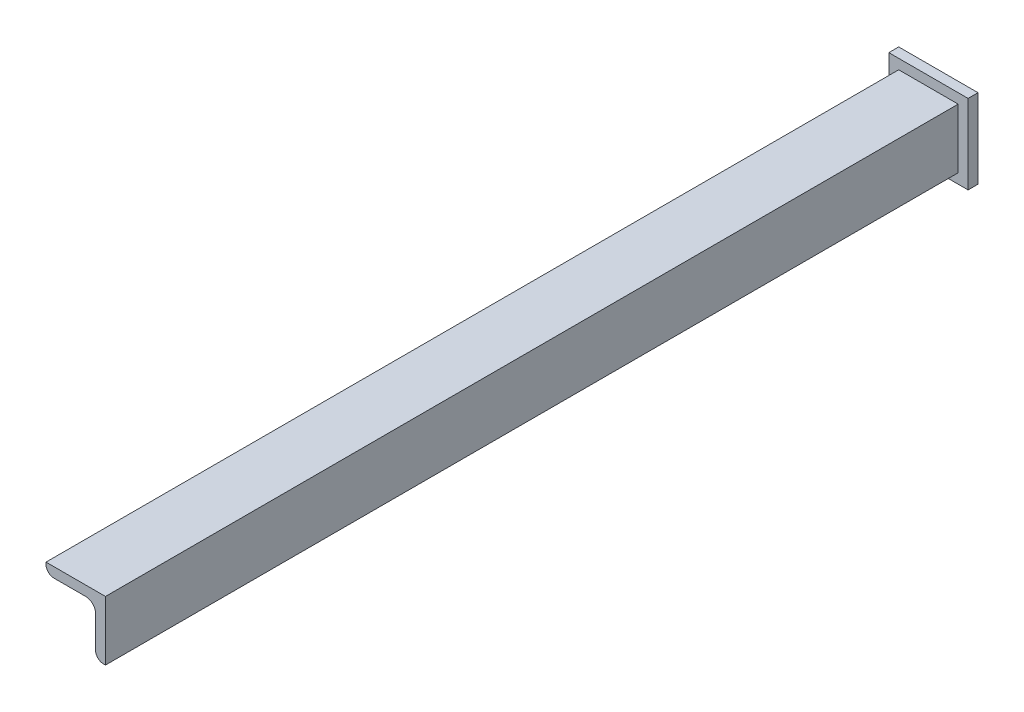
ISO-10303-21;
HEADER;
FILE_DESCRIPTION(('STEP AP214'),'2;1');
FILE_NAME('part.step','',(''),(''),'','','');
FILE_SCHEMA(('AUTOMOTIVE_DESIGN { 1 0 10303 214 1 1 1 1 }'));
ENDSEC;
DATA;
#1=APPLICATION_CONTEXT('core data for automotive mechanical design processes');
#2=APPLICATION_PROTOCOL_DEFINITION('international standard','automotive_design',2000,#1);
#3=PRODUCT_CONTEXT('',#1,'mechanical');
#4=PRODUCT('Part','Part','',(#3));
#5=PRODUCT_RELATED_PRODUCT_CATEGORY('part','',(#4));
#6=PRODUCT_DEFINITION_FORMATION('','',#4);
#7=PRODUCT_DEFINITION_CONTEXT('part definition',#1,'design');
#8=PRODUCT_DEFINITION('design','',#6,#7);
#9=PRODUCT_DEFINITION_SHAPE('','',#8);
#10=(LENGTH_UNIT() NAMED_UNIT(*) SI_UNIT(.MILLI.,.METRE.));
#11=(NAMED_UNIT(*) PLANE_ANGLE_UNIT() SI_UNIT($,.RADIAN.));
#12=(NAMED_UNIT(*) SI_UNIT($,.STERADIAN.) SOLID_ANGLE_UNIT());
#13=UNCERTAINTY_MEASURE_WITH_UNIT(LENGTH_MEASURE(1.E-05),#10,'distance_accuracy_value','');
#14=(GEOMETRIC_REPRESENTATION_CONTEXT(3) GLOBAL_UNCERTAINTY_ASSIGNED_CONTEXT((#13)) GLOBAL_UNIT_ASSIGNED_CONTEXT((#10,
#11,#12)) REPRESENTATION_CONTEXT('',''));
#15=CARTESIAN_POINT('',(0.,0.,0.));
#16=DIRECTION('',(0.,0.,1.));
#17=DIRECTION('',(1.,0.,0.));
#18=AXIS2_PLACEMENT_3D('',#15,#16,#17);
#19=CARTESIAN_POINT('',(0.,0.,10.));
#20=DIRECTION('',(0.,0.,-1.));
#21=DIRECTION('',(-1.,0.,0.));
#22=AXIS2_PLACEMENT_3D('',#19,#20,#21);
#23=PLANE('',#22);
#24=CARTESIAN_POINT('',(2981.89372495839,-50.1062373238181,10.));
#25=DIRECTION('',(0.,0.,1.));
#26=DIRECTION('',(1.,0.,0.));
#27=AXIS2_PLACEMENT_3D('',#24,#25,#26);
#28=CIRCLE('',#27,7.49999999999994);
#29=CARTESIAN_POINT('',(2989.39372495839,-50.1062373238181,10.));
#30=VERTEX_POINT('',#29);
#31=EDGE_CURVE('E411',#30,#30,#28,.T.);
#32=ORIENTED_EDGE('',*,*,#31,.F.);
#33=EDGE_LOOP('',(#32));
#34=FACE_BOUND('',#33,.T.);
#35=DIRECTION('',(1.,0.,0.));
#36=VECTOR('',#35,1.);
#37=CARTESIAN_POINT('',(2951.999903,0.,10.));
#38=LINE('',#37,#36);
#39=CARTESIAN_POINT('',(2951.999903,0.,10.));
#40=VERTEX_POINT('',#39);
#41=CARTESIAN_POINT('',(3032.000065,0.,10.));
#42=VERTEX_POINT('',#41);
#43=EDGE_CURVE('E181',#40,#42,#38,.T.);
#44=ORIENTED_EDGE('',*,*,#43,.F.);
#45=DIRECTION('',(0.,1.,0.));
#46=VECTOR('',#45,1.);
#47=CARTESIAN_POINT('',(2951.999903,-79.999998,10.));
#48=LINE('',#47,#46);
#49=CARTESIAN_POINT('',(2951.999903,-79.999998,10.));
#50=VERTEX_POINT('',#49);
#51=EDGE_CURVE('E191',#50,#40,#48,.T.);
#52=ORIENTED_EDGE('',*,*,#51,.F.);
#53=DIRECTION('',(-1.,0.,0.));
#54=VECTOR('',#53,1.);
#55=CARTESIAN_POINT('',(3032.000065,-79.999998,10.));
#56=LINE('',#55,#54);
#57=CARTESIAN_POINT('',(3032.000065,-79.999998,10.));
#58=VERTEX_POINT('',#57);
#59=EDGE_CURVE('E188',#58,#50,#56,.T.);
#60=ORIENTED_EDGE('',*,*,#59,.F.);
#61=DIRECTION('',(0.,-1.,0.));
#62=VECTOR('',#61,1.);
#63=CARTESIAN_POINT('',(3032.000065,0.,10.));
#64=LINE('',#63,#62);
#65=EDGE_CURVE('E184',#42,#58,#64,.T.);
#66=ORIENTED_EDGE('',*,*,#65,.F.);
#67=EDGE_LOOP('',(#44,#52,#60,#66));
#68=FACE_BOUND('',#67,.T.);
#69=DIRECTION('',(0.,-1.,0.));
#70=VECTOR('',#69,1.);
#71=CARTESIAN_POINT('',(3012.000084,-70.,10.));
#72=LINE('',#71,#70);
#73=CARTESIAN_POINT('',(3012.000084,-30.0040008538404,10.));
#74=VERTEX_POINT('',#73);
#75=CARTESIAN_POINT('',(3012.000084,-62.,10.));
#76=VERTEX_POINT('',#75);
#77=EDGE_CURVE('E168',#74,#76,#72,.T.);
#78=ORIENTED_EDGE('',*,*,#77,.F.);
#79=CARTESIAN_POINT('',(3002.000084,-30.0040008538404,10.));
#80=DIRECTION('',(0.,0.,-1.));
#81=DIRECTION('',(-1.,0.,0.));
#82=AXIS2_PLACEMENT_3D('',#79,#80,#81);
#83=CIRCLE('',#82,10.);
#84=CARTESIAN_POINT('',(3002.00108419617,-20.00400090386,10.));
#85=VERTEX_POINT('',#84);
#86=EDGE_CURVE('E215',#74,#85,#83,.F.);
#87=ORIENTED_EDGE('',*,*,#86,.T.);
#88=DIRECTION('',(0.999999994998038,-0.000100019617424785,0.));
#89=VECTOR('',#88,1.);
#90=CARTESIAN_POINT('',(3012.000084,-20.005001,10.));
#91=LINE('',#90,#89);
#92=CARTESIAN_POINT('',(2969.99909284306,-20.000800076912,10.));
#93=VERTEX_POINT('',#92);
#94=EDGE_CURVE('E165',#93,#85,#91,.T.);
#95=ORIENTED_EDGE('',*,*,#94,.F.);
#96=CARTESIAN_POINT('',(2969.999893,-12.0008001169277,10.));
#97=DIRECTION('',(0.,0.,-1.));
#98=DIRECTION('',(-1.,0.,0.));
#99=AXIS2_PLACEMENT_3D('',#96,#97,#98);
#100=CIRCLE('',#99,8.);
#101=CARTESIAN_POINT('',(2961.999893,-12.0008001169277,10.));
#102=VERTEX_POINT('',#101);
#103=EDGE_CURVE('E11',#93,#102,#100,.T.);
#104=ORIENTED_EDGE('',*,*,#103,.T.);
#105=DIRECTION('',(0.,-1.,0.));
#106=VECTOR('',#105,1.);
#107=CARTESIAN_POINT('',(2961.999893,-20.,10.));
#108=LINE('',#107,#106);
#109=CARTESIAN_POINT('',(2961.999893,-10.,10.));
#110=VERTEX_POINT('',#109);
#111=EDGE_CURVE('E163',#110,#102,#108,.T.);
#112=ORIENTED_EDGE('',*,*,#111,.F.);
#113=DIRECTION('',(-0.999999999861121,-1.66660864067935E-05,0.));
#114=VECTOR('',#113,1.);
#115=CARTESIAN_POINT('',(2961.999893,-10.,10.));
#116=LINE('',#115,#114);
#117=CARTESIAN_POINT('',(3022.001982,-9.999,10.));
#118=VERTEX_POINT('',#117);
#119=EDGE_CURVE('E174',#118,#110,#116,.T.);
#120=ORIENTED_EDGE('',*,*,#119,.F.);
#121=DIRECTION('',(3.17994700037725E-05,0.999999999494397,0.));
#122=VECTOR('',#121,1.);
#123=CARTESIAN_POINT('',(3022.001982,-9.999,10.));
#124=LINE('',#123,#122);
#125=CARTESIAN_POINT('',(3022.000074,-70.,10.));
#126=VERTEX_POINT('',#125);
#127=EDGE_CURVE('E172',#126,#118,#124,.T.);
#128=ORIENTED_EDGE('',*,*,#127,.F.);
#129=DIRECTION('',(1.,0.,0.));
#130=VECTOR('',#129,1.);
#131=CARTESIAN_POINT('',(3022.000074,-70.,10.));
#132=LINE('',#131,#130);
#133=CARTESIAN_POINT('',(3020.000084,-70.,10.));
#134=VERTEX_POINT('',#133);
#135=EDGE_CURVE('E147',#134,#126,#132,.T.);
#136=ORIENTED_EDGE('',*,*,#135,.F.);
#137=CARTESIAN_POINT('',(3020.000084,-62.,10.));
#138=DIRECTION('',(0.,0.,-1.));
#139=DIRECTION('',(-1.,0.,0.));
#140=AXIS2_PLACEMENT_3D('',#137,#138,#139);
#141=CIRCLE('',#140,8.);
#142=EDGE_CURVE('E45',#134,#76,#141,.T.);
#143=ORIENTED_EDGE('',*,*,#142,.T.);
#144=EDGE_LOOP('',(#78,#87,#95,#104,#112,#120,#128,#136,#143));
#145=FACE_BOUND('',#144,.T.);
#146=ADVANCED_FACE('F37',(#34,#68,#145),#23,.F.);
#147=CARTESIAN_POINT('',(2951.999903,0.,10.));
#148=DIRECTION('',(0.,1.,0.));
#149=DIRECTION('',(0.,0.,1.));
#150=AXIS2_PLACEMENT_3D('',#147,#148,#149);
#151=PLANE('',#150);
#152=DIRECTION('',(1.,0.,0.));
#153=VECTOR('',#152,1.);
#154=CARTESIAN_POINT('',(2951.999903,0.,0.));
#155=LINE('',#154,#153);
#156=CARTESIAN_POINT('',(2951.999903,0.,0.));
#157=VERTEX_POINT('',#156);
#158=CARTESIAN_POINT('',(3032.000065,0.,0.));
#159=VERTEX_POINT('',#158);
#160=EDGE_CURVE('E151',#157,#159,#155,.T.);
#161=ORIENTED_EDGE('',*,*,#160,.F.);
#162=DIRECTION('',(0.,0.,-1.));
#163=VECTOR('',#162,1.);
#164=CARTESIAN_POINT('',(2951.999903,0.,10.));
#165=LINE('',#164,#163);
#166=EDGE_CURVE('E205',#40,#157,#165,.T.);
#167=ORIENTED_EDGE('',*,*,#166,.F.);
#168=ORIENTED_EDGE('',*,*,#43,.T.);
#169=DIRECTION('',(0.,0.,-1.));
#170=VECTOR('',#169,1.);
#171=CARTESIAN_POINT('',(3032.000065,0.,10.));
#172=LINE('',#171,#170);
#173=EDGE_CURVE('E194',#42,#159,#172,.T.);
#174=ORIENTED_EDGE('',*,*,#173,.T.);
#175=EDGE_LOOP('',(#161,#167,#168,#174));
#176=FACE_BOUND('',#175,.T.);
#177=ADVANCED_FACE('F251',(#176),#151,.T.);
#178=CARTESIAN_POINT('',(2951.999903,-79.999998,10.));
#179=DIRECTION('',(-1.,0.,0.));
#180=DIRECTION('',(0.,0.,1.));
#181=AXIS2_PLACEMENT_3D('',#178,#179,#180);
#182=PLANE('',#181);
#183=DIRECTION('',(0.,1.,0.));
#184=VECTOR('',#183,1.);
#185=CARTESIAN_POINT('',(2951.999903,-79.999998,0.));
#186=LINE('',#185,#184);
#187=CARTESIAN_POINT('',(2951.999903,-79.999998,0.));
#188=VERTEX_POINT('',#187);
#189=EDGE_CURVE('E185',#188,#157,#186,.T.);
#190=ORIENTED_EDGE('',*,*,#189,.F.);
#191=DIRECTION('',(0.,0.,-1.));
#192=VECTOR('',#191,1.);
#193=CARTESIAN_POINT('',(2951.999903,-79.999998,10.));
#194=LINE('',#193,#192);
#195=EDGE_CURVE('E208',#50,#188,#194,.T.);
#196=ORIENTED_EDGE('',*,*,#195,.F.);
#197=ORIENTED_EDGE('',*,*,#51,.T.);
#198=ORIENTED_EDGE('',*,*,#166,.T.);
#199=EDGE_LOOP('',(#190,#196,#197,#198));
#200=FACE_BOUND('',#199,.T.);
#201=ADVANCED_FACE('F257',(#200),#182,.T.);
#202=CARTESIAN_POINT('',(3032.000065,-79.999998,10.));
#203=DIRECTION('',(0.,-1.,0.));
#204=DIRECTION('',(0.,0.,-1.));
#205=AXIS2_PLACEMENT_3D('',#202,#203,#204);
#206=PLANE('',#205);
#207=DIRECTION('',(-1.,0.,0.));
#208=VECTOR('',#207,1.);
#209=CARTESIAN_POINT('',(3032.000065,-79.999998,0.));
#210=LINE('',#209,#208);
#211=CARTESIAN_POINT('',(3032.000065,-79.999998,0.));
#212=VERTEX_POINT('',#211);
#213=EDGE_CURVE('E200',#212,#188,#210,.T.);
#214=ORIENTED_EDGE('',*,*,#213,.F.);
#215=DIRECTION('',(0.,0.,-1.));
#216=VECTOR('',#215,1.);
#217=CARTESIAN_POINT('',(3032.000065,-79.999998,10.));
#218=LINE('',#217,#216);
#219=EDGE_CURVE('E210',#58,#212,#218,.T.);
#220=ORIENTED_EDGE('',*,*,#219,.F.);
#221=ORIENTED_EDGE('',*,*,#59,.T.);
#222=ORIENTED_EDGE('',*,*,#195,.T.);
#223=EDGE_LOOP('',(#214,#220,#221,#222));
#224=FACE_BOUND('',#223,.T.);
#225=ADVANCED_FACE('F273',(#224),#206,.T.);
#226=CARTESIAN_POINT('',(3032.000065,0.,10.));
#227=DIRECTION('',(1.,0.,0.));
#228=DIRECTION('',(0.,0.,-1.));
#229=AXIS2_PLACEMENT_3D('',#226,#227,#228);
#230=PLANE('',#229);
#231=DIRECTION('',(0.,-1.,0.));
#232=VECTOR('',#231,1.);
#233=CARTESIAN_POINT('',(3032.000065,0.,0.));
#234=LINE('',#233,#232);
#235=EDGE_CURVE('E197',#159,#212,#234,.T.);
#236=ORIENTED_EDGE('',*,*,#235,.F.);
#237=ORIENTED_EDGE('',*,*,#173,.F.);
#238=ORIENTED_EDGE('',*,*,#65,.T.);
#239=ORIENTED_EDGE('',*,*,#219,.T.);
#240=EDGE_LOOP('',(#236,#237,#238,#239));
#241=FACE_BOUND('',#240,.T.);
#242=ADVANCED_FACE('F269',(#241),#230,.T.);
#243=CARTESIAN_POINT('',(0.,0.,0.));
#244=DIRECTION('',(0.,0.,-1.));
#245=DIRECTION('',(-1.,0.,0.));
#246=AXIS2_PLACEMENT_3D('',#243,#244,#245);
#247=PLANE('',#246);
#248=CARTESIAN_POINT('',(2981.89372495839,-50.1062373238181,0.));
#249=DIRECTION('',(0.,0.,1.));
#250=DIRECTION('',(1.,0.,0.));
#251=AXIS2_PLACEMENT_3D('',#248,#249,#250);
#252=CIRCLE('',#251,7.49999999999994);
#253=CARTESIAN_POINT('',(2989.39372495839,-50.1062373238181,0.));
#254=VERTEX_POINT('',#253);
#255=EDGE_CURVE('E166',#254,#254,#252,.T.);
#256=ORIENTED_EDGE('',*,*,#255,.T.);
#257=EDGE_LOOP('',(#256));
#258=FACE_BOUND('',#257,.T.);
#259=ORIENTED_EDGE('',*,*,#160,.T.);
#260=ORIENTED_EDGE('',*,*,#235,.T.);
#261=ORIENTED_EDGE('',*,*,#213,.T.);
#262=ORIENTED_EDGE('',*,*,#189,.T.);
#263=EDGE_LOOP('',(#259,#260,#261,#262));
#264=FACE_BOUND('',#263,.T.);
#265=ADVANCED_FACE('F266',(#258,#264),#247,.T.);
#266=CARTESIAN_POINT('',(2961.999893,-20.,870.31));
#267=DIRECTION('',(1.,0.,0.));
#268=DIRECTION('',(0.,0.,-1.));
#269=AXIS2_PLACEMENT_3D('',#266,#267,#268);
#270=PLANE('',#269);
#271=ORIENTED_EDGE('',*,*,#111,.T.);
#272=DIRECTION('',(0.,0.,-1.));
#273=VECTOR('',#272,1.);
#274=CARTESIAN_POINT('',(2961.999893,-12.0008001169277,870.31));
#275=LINE('',#274,#273);
#276=CARTESIAN_POINT('',(2961.999893,-12.0008001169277,870.31));
#277=VERTEX_POINT('',#276);
#278=EDGE_CURVE('E232',#102,#277,#275,.F.);
#279=ORIENTED_EDGE('',*,*,#278,.T.);
#280=DIRECTION('',(0.,-1.,0.));
#281=VECTOR('',#280,1.);
#282=CARTESIAN_POINT('',(2961.999893,-20.,870.31));
#283=LINE('',#282,#281);
#284=CARTESIAN_POINT('',(2961.999893,-10.,870.31));
#285=VERTEX_POINT('',#284);
#286=EDGE_CURVE('E177',#285,#277,#283,.T.);
#287=ORIENTED_EDGE('',*,*,#286,.F.);
#288=DIRECTION('',(0.,0.,-1.));
#289=VECTOR('',#288,1.);
#290=CARTESIAN_POINT('',(2961.999893,-10.,870.31));
#291=LINE('',#290,#289);
#292=EDGE_CURVE('E159',#285,#110,#291,.T.);
#293=ORIENTED_EDGE('',*,*,#292,.T.);
#294=EDGE_LOOP('',(#271,#279,#287,#293));
#295=FACE_BOUND('',#294,.T.);
#296=ADVANCED_FACE('F264',(#295),#270,.F.);
#297=CARTESIAN_POINT('',(3012.000084,-20.005001,870.31));
#298=DIRECTION('',(0.000100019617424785,0.999999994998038,0.));
#299=DIRECTION('',(-0.999999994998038,0.000100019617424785,0.));
#300=AXIS2_PLACEMENT_3D('',#297,#298,#299);
#301=PLANE('',#300);
#302=DIRECTION('',(0.999999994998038,-0.000100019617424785,0.));
#303=VECTOR('',#302,1.);
#304=CARTESIAN_POINT('',(3012.000084,-20.005001,870.31));
#305=LINE('',#304,#303);
#306=CARTESIAN_POINT('',(2969.99909284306,-20.000800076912,870.31));
#307=VERTEX_POINT('',#306);
#308=CARTESIAN_POINT('',(3002.00108419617,-20.00400090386,870.31));
#309=VERTEX_POINT('',#308);
#310=EDGE_CURVE('E417',#307,#309,#305,.T.);
#311=ORIENTED_EDGE('',*,*,#310,.F.);
#312=DIRECTION('',(0.,0.,-1.));
#313=VECTOR('',#312,1.);
#314=CARTESIAN_POINT('',(2969.99909284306,-20.000800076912,870.31));
#315=LINE('',#314,#313);
#316=EDGE_CURVE('E230',#307,#93,#315,.T.);
#317=ORIENTED_EDGE('',*,*,#316,.T.);
#318=ORIENTED_EDGE('',*,*,#94,.T.);
#319=DIRECTION('',(0.,0.,-1.));
#320=VECTOR('',#319,1.);
#321=CARTESIAN_POINT('',(3002.00108419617,-20.00400090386,870.31));
#322=LINE('',#321,#320);
#323=EDGE_CURVE('E218',#85,#309,#322,.F.);
#324=ORIENTED_EDGE('',*,*,#323,.T.);
#325=EDGE_LOOP('',(#311,#317,#318,#324));
#326=FACE_BOUND('',#325,.T.);
#327=ADVANCED_FACE('F306',(#326),#301,.F.);
#328=CARTESIAN_POINT('',(3012.000084,-70.,870.31));
#329=DIRECTION('',(1.,0.,0.));
#330=DIRECTION('',(0.,0.,-1.));
#331=AXIS2_PLACEMENT_3D('',#328,#329,#330);
#332=PLANE('',#331);
#333=ORIENTED_EDGE('',*,*,#77,.T.);
#334=DIRECTION('',(0.,0.,-1.));
#335=VECTOR('',#334,1.);
#336=CARTESIAN_POINT('',(3012.000084,-62.,870.31));
#337=LINE('',#336,#335);
#338=CARTESIAN_POINT('',(3012.000084,-62.,870.31));
#339=VERTEX_POINT('',#338);
#340=EDGE_CURVE('E225',#76,#339,#337,.F.);
#341=ORIENTED_EDGE('',*,*,#340,.T.);
#342=DIRECTION('',(0.,-1.,0.));
#343=VECTOR('',#342,1.);
#344=CARTESIAN_POINT('',(3012.000084,-70.,870.31));
#345=LINE('',#344,#343);
#346=CARTESIAN_POINT('',(3012.000084,-30.0040008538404,870.31));
#347=VERTEX_POINT('',#346);
#348=EDGE_CURVE('E141',#347,#339,#345,.T.);
#349=ORIENTED_EDGE('',*,*,#348,.F.);
#350=DIRECTION('',(0.,0.,-1.));
#351=VECTOR('',#350,1.);
#352=CARTESIAN_POINT('',(3012.000084,-30.0040008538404,10.));
#353=LINE('',#352,#351);
#354=EDGE_CURVE('E207',#347,#74,#353,.T.);
#355=ORIENTED_EDGE('',*,*,#354,.T.);
#356=EDGE_LOOP('',(#333,#341,#349,#355));
#357=FACE_BOUND('',#356,.T.);
#358=ADVANCED_FACE('F237',(#357),#332,.F.);
#359=CARTESIAN_POINT('',(3022.000074,-70.,870.31));
#360=DIRECTION('',(0.,1.,0.));
#361=DIRECTION('',(0.,0.,1.));
#362=AXIS2_PLACEMENT_3D('',#359,#360,#361);
#363=PLANE('',#362);
#364=DIRECTION('',(1.,0.,0.));
#365=VECTOR('',#364,1.);
#366=CARTESIAN_POINT('',(3022.000074,-70.,870.31));
#367=LINE('',#366,#365);
#368=CARTESIAN_POINT('',(3020.000084,-70.,870.31));
#369=VERTEX_POINT('',#368);
#370=CARTESIAN_POINT('',(3022.000074,-70.,870.31));
#371=VERTEX_POINT('',#370);
#372=EDGE_CURVE('E129',#369,#371,#367,.T.);
#373=ORIENTED_EDGE('',*,*,#372,.F.);
#374=DIRECTION('',(0.,0.,-1.));
#375=VECTOR('',#374,1.);
#376=CARTESIAN_POINT('',(3020.000084,-70.,870.31));
#377=LINE('',#376,#375);
#378=EDGE_CURVE('E223',#369,#134,#377,.T.);
#379=ORIENTED_EDGE('',*,*,#378,.T.);
#380=ORIENTED_EDGE('',*,*,#135,.T.);
#381=DIRECTION('',(0.,0.,-1.));
#382=VECTOR('',#381,1.);
#383=CARTESIAN_POINT('',(3022.000074,-70.,870.31));
#384=LINE('',#383,#382);
#385=EDGE_CURVE('E144',#371,#126,#384,.T.);
#386=ORIENTED_EDGE('',*,*,#385,.F.);
#387=EDGE_LOOP('',(#373,#379,#380,#386));
#388=FACE_BOUND('',#387,.T.);
#389=ADVANCED_FACE('F145',(#388),#363,.F.);
#390=CARTESIAN_POINT('',(3022.001982,-9.999,870.31));
#391=DIRECTION('',(-0.999999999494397,3.17994700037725E-05,0.));
#392=DIRECTION('',(-3.17994700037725E-05,-0.999999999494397,0.));
#393=AXIS2_PLACEMENT_3D('',#390,#391,#392);
#394=PLANE('',#393);
#395=ORIENTED_EDGE('',*,*,#127,.T.);
#396=DIRECTION('',(0.,0.,-1.));
#397=VECTOR('',#396,1.);
#398=CARTESIAN_POINT('',(3022.001982,-9.999,870.31));
#399=LINE('',#398,#397);
#400=CARTESIAN_POINT('',(3022.001982,-9.999,870.31));
#401=VERTEX_POINT('',#400);
#402=EDGE_CURVE('E152',#401,#118,#399,.T.);
#403=ORIENTED_EDGE('',*,*,#402,.F.);
#404=DIRECTION('',(3.17994700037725E-05,0.999999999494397,0.));
#405=VECTOR('',#404,1.);
#406=CARTESIAN_POINT('',(3022.001982,-9.999,870.31));
#407=LINE('',#406,#405);
#408=EDGE_CURVE('E134',#371,#401,#407,.T.);
#409=ORIENTED_EDGE('',*,*,#408,.F.);
#410=ORIENTED_EDGE('',*,*,#385,.T.);
#411=EDGE_LOOP('',(#395,#403,#409,#410));
#412=FACE_BOUND('',#411,.T.);
#413=ADVANCED_FACE('F154',(#412),#394,.F.);
#414=CARTESIAN_POINT('',(2961.999893,-10.,870.31));
#415=DIRECTION('',(1.66660864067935E-05,-0.999999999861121,0.));
#416=DIRECTION('',(0.999999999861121,1.66660864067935E-05,0.));
#417=AXIS2_PLACEMENT_3D('',#414,#415,#416);
#418=PLANE('',#417);
#419=ORIENTED_EDGE('',*,*,#119,.T.);
#420=ORIENTED_EDGE('',*,*,#292,.F.);
#421=DIRECTION('',(-0.999999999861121,-1.66660864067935E-05,0.));
#422=VECTOR('',#421,1.);
#423=CARTESIAN_POINT('',(2961.999893,-10.,870.31));
#424=LINE('',#423,#422);
#425=EDGE_CURVE('E157',#401,#285,#424,.T.);
#426=ORIENTED_EDGE('',*,*,#425,.F.);
#427=ORIENTED_EDGE('',*,*,#402,.T.);
#428=EDGE_LOOP('',(#419,#420,#426,#427));
#429=FACE_BOUND('',#428,.T.);
#430=ADVANCED_FACE('F331',(#429),#418,.F.);
#431=CARTESIAN_POINT('',(0.,0.,870.31));
#432=DIRECTION('',(0.,0.,1.));
#433=DIRECTION('',(1.,0.,0.));
#434=AXIS2_PLACEMENT_3D('',#431,#432,#433);
#435=PLANE('',#434);
#436=ORIENTED_EDGE('',*,*,#348,.T.);
#437=CARTESIAN_POINT('',(3020.000084,-62.,870.31));
#438=DIRECTION('',(0.,0.,1.));
#439=DIRECTION('',(1.,0.,0.));
#440=AXIS2_PLACEMENT_3D('',#437,#438,#439);
#441=CIRCLE('',#440,8.);
#442=EDGE_CURVE('E137',#339,#369,#441,.T.);
#443=ORIENTED_EDGE('',*,*,#442,.T.);
#444=ORIENTED_EDGE('',*,*,#372,.T.);
#445=ORIENTED_EDGE('',*,*,#408,.T.);
#446=ORIENTED_EDGE('',*,*,#425,.T.);
#447=ORIENTED_EDGE('',*,*,#286,.T.);
#448=CARTESIAN_POINT('',(2969.999893,-12.0008001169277,870.31));
#449=DIRECTION('',(0.,0.,1.));
#450=DIRECTION('',(1.,0.,0.));
#451=AXIS2_PLACEMENT_3D('',#448,#449,#450);
#452=CIRCLE('',#451,8.);
#453=EDGE_CURVE('E227',#277,#307,#452,.T.);
#454=ORIENTED_EDGE('',*,*,#453,.T.);
#455=ORIENTED_EDGE('',*,*,#310,.T.);
#456=CARTESIAN_POINT('',(3002.000084,-30.0040008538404,870.31));
#457=DIRECTION('',(0.,0.,1.));
#458=DIRECTION('',(1.,0.,0.));
#459=AXIS2_PLACEMENT_3D('',#456,#457,#458);
#460=CIRCLE('',#459,10.);
#461=EDGE_CURVE('E221',#309,#347,#460,.F.);
#462=ORIENTED_EDGE('',*,*,#461,.T.);
#463=EDGE_LOOP('',(#436,#443,#444,#445,#446,#447,#454,#455,#462));
#464=FACE_BOUND('',#463,.T.);
#465=ADVANCED_FACE('F132',(#464),#435,.T.);
#466=CARTESIAN_POINT('',(2981.89372495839,-50.1062373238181,0.));
#467=DIRECTION('',(0.,0.,1.));
#468=DIRECTION('',(1.,0.,0.));
#469=AXIS2_PLACEMENT_3D('',#466,#467,#468);
#470=CYLINDRICAL_SURFACE('',#469,7.49999999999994);
#471=ORIENTED_EDGE('',*,*,#255,.F.);
#472=EDGE_LOOP('',(#471));
#473=FACE_BOUND('',#472,.T.);
#474=ORIENTED_EDGE('',*,*,#31,.T.);
#475=EDGE_LOOP('',(#474));
#476=FACE_BOUND('',#475,.T.);
#477=ADVANCED_FACE('F247',(#473,#476),#470,.F.);
#478=CARTESIAN_POINT('',(3002.000084,-30.0040008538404,870.31));
#479=DIRECTION('',(0.,0.,1.));
#480=DIRECTION('',(1.,0.,0.));
#481=AXIS2_PLACEMENT_3D('',#478,#479,#480);
#482=CYLINDRICAL_SURFACE('',#481,10.);
#483=ORIENTED_EDGE('',*,*,#461,.F.);
#484=ORIENTED_EDGE('',*,*,#323,.F.);
#485=ORIENTED_EDGE('',*,*,#86,.F.);
#486=ORIENTED_EDGE('',*,*,#354,.F.);
#487=EDGE_LOOP('',(#483,#484,#485,#486));
#488=FACE_BOUND('',#487,.T.);
#489=ADVANCED_FACE('F242',(#488),#482,.F.);
#490=CARTESIAN_POINT('',(3020.000084,-62.,870.31));
#491=DIRECTION('',(0.,0.,-1.));
#492=DIRECTION('',(-1.,0.,0.));
#493=AXIS2_PLACEMENT_3D('',#490,#491,#492);
#494=CYLINDRICAL_SURFACE('',#493,8.);
#495=ORIENTED_EDGE('',*,*,#442,.F.);
#496=ORIENTED_EDGE('',*,*,#340,.F.);
#497=ORIENTED_EDGE('',*,*,#142,.F.);
#498=ORIENTED_EDGE('',*,*,#378,.F.);
#499=EDGE_LOOP('',(#495,#496,#497,#498));
#500=FACE_BOUND('',#499,.T.);
#501=ADVANCED_FACE('F240',(#500),#494,.T.);
#502=CARTESIAN_POINT('',(2969.999893,-12.0008001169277,870.31));
#503=DIRECTION('',(0.,0.,-1.));
#504=DIRECTION('',(-1.,0.,0.));
#505=AXIS2_PLACEMENT_3D('',#502,#503,#504);
#506=CYLINDRICAL_SURFACE('',#505,8.);
#507=ORIENTED_EDGE('',*,*,#453,.F.);
#508=ORIENTED_EDGE('',*,*,#278,.F.);
#509=ORIENTED_EDGE('',*,*,#103,.F.);
#510=ORIENTED_EDGE('',*,*,#316,.F.);
#511=EDGE_LOOP('',(#507,#508,#509,#510));
#512=FACE_BOUND('',#511,.T.);
#513=ADVANCED_FACE('F39',(#512),#506,.T.);
#514=CLOSED_SHELL('',(#146,#177,#201,#225,#242,#265,#296,#327,#358,#389,#413,#430,#465,#477,
#489,#501,#513));
#515=MANIFOLD_SOLID_BREP('B2',#514);
#516=ADVANCED_BREP_SHAPE_REPRESENTATION('',(#18,#515),#14);
#517=SHAPE_DEFINITION_REPRESENTATION(#9,#516);
ENDSEC;
END-ISO-10303-21;
